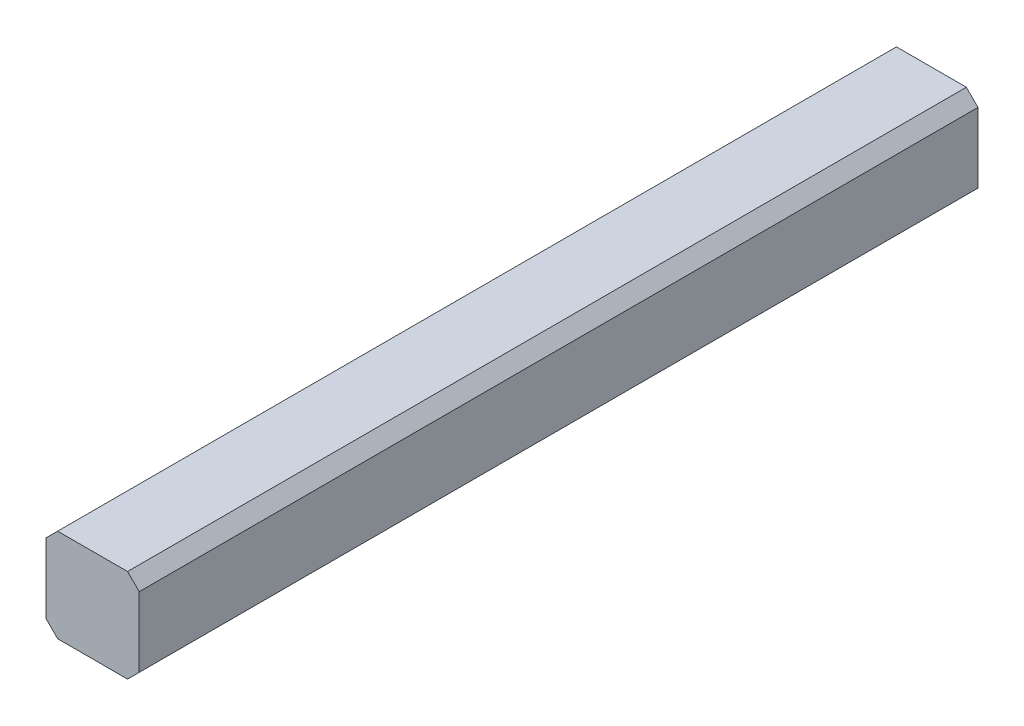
from build123d import *

# Parameters (mm, degrees)
BODY_W         = 2
BODY_H         = 2
EXTRUDE1_DEPTH = 18
CHAMFER1_SIZE  = 0.25


with BuildPart() as part:
    # body → Extrude1 (new body)
    with BuildSketch(Plane.XY):
        with Locations((1, 1)):
            Rectangle(BODY_W, BODY_H)
    extrude(amount=EXTRUDE1_DEPTH)

    # Chamfer1
    chamfer1_edges = [part.edges().sort_by_distance(p)[0] for p in [
        (0, 2, 9),
        (2, 2, 9),
        (2, 0, 9),
        (0, 0, 9),
    ]]
    chamfer(chamfer1_edges, length=CHAMFER1_SIZE)


solid = part.part
